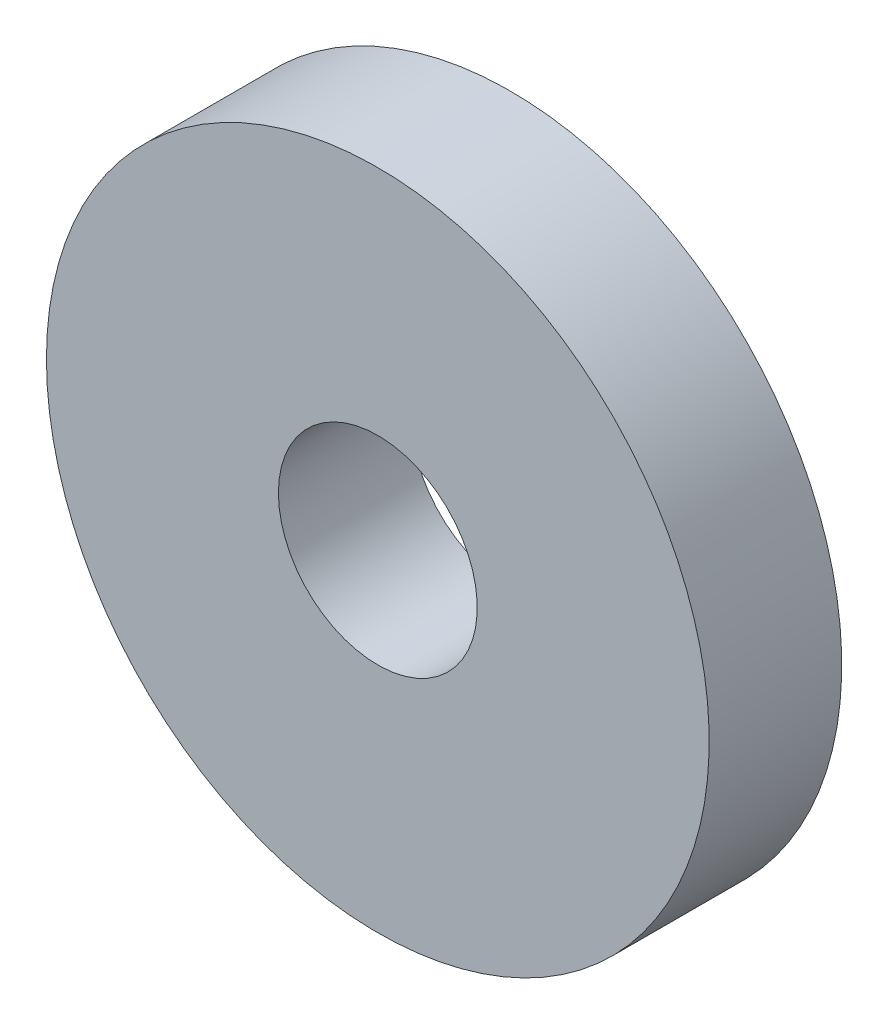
ISO-10303-21;
HEADER;
FILE_DESCRIPTION(('STEP AP214'),'2;1');
FILE_NAME('part.step','',(''),(''),'','','');
FILE_SCHEMA(('AUTOMOTIVE_DESIGN { 1 0 10303 214 1 1 1 1 }'));
ENDSEC;
DATA;
#1=APPLICATION_CONTEXT('core data for automotive mechanical design processes');
#2=APPLICATION_PROTOCOL_DEFINITION('international standard','automotive_design',2000,#1);
#3=PRODUCT_CONTEXT('',#1,'mechanical');
#4=PRODUCT('Part','Part','',(#3));
#5=PRODUCT_RELATED_PRODUCT_CATEGORY('part','',(#4));
#6=PRODUCT_DEFINITION_FORMATION('','',#4);
#7=PRODUCT_DEFINITION_CONTEXT('part definition',#1,'design');
#8=PRODUCT_DEFINITION('design','',#6,#7);
#9=PRODUCT_DEFINITION_SHAPE('','',#8);
#10=(LENGTH_UNIT() NAMED_UNIT(*) SI_UNIT(.MILLI.,.METRE.));
#11=(NAMED_UNIT(*) PLANE_ANGLE_UNIT() SI_UNIT($,.RADIAN.));
#12=(NAMED_UNIT(*) SI_UNIT($,.STERADIAN.) SOLID_ANGLE_UNIT());
#13=UNCERTAINTY_MEASURE_WITH_UNIT(LENGTH_MEASURE(1.E-05),#10,'distance_accuracy_value','');
#14=(GEOMETRIC_REPRESENTATION_CONTEXT(3) GLOBAL_UNCERTAINTY_ASSIGNED_CONTEXT((#13)) GLOBAL_UNIT_ASSIGNED_CONTEXT((#10,
#11,#12)) REPRESENTATION_CONTEXT('',''));
#15=CARTESIAN_POINT('',(0.,0.,0.));
#16=DIRECTION('',(0.,0.,1.));
#17=DIRECTION('',(1.,0.,0.));
#18=AXIS2_PLACEMENT_3D('',#15,#16,#17);
#19=CARTESIAN_POINT('',(0.,0.,9.9999999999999));
#20=DIRECTION('',(0.,0.,0.999999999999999));
#21=DIRECTION('',(1.,0.,0.));
#22=AXIS2_PLACEMENT_3D('',#19,#20,#21);
#23=PLANE('',#22);
#24=CARTESIAN_POINT('',(0.,0.,9.9999999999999));
#25=DIRECTION('',(0.,0.,0.999999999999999));
#26=DIRECTION('',(1.,0.,0.));
#27=AXIS2_PLACEMENT_3D('',#24,#25,#26);
#28=CIRCLE('',#27,25.);
#29=CARTESIAN_POINT('',(-25.,0.,9.9999999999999));
#30=VERTEX_POINT('',#29);
#31=EDGE_CURVE('E10',#30,#30,#28,.T.);
#32=ORIENTED_EDGE('',*,*,#31,.T.);
#33=EDGE_LOOP('',(#32));
#34=FACE_BOUND('',#33,.T.);
#35=CARTESIAN_POINT('',(0.,0.,9.9999999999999));
#36=DIRECTION('',(0.,0.,0.999999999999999));
#37=DIRECTION('',(1.,0.,0.));
#38=AXIS2_PLACEMENT_3D('',#35,#36,#37);
#39=CIRCLE('',#38,7.5);
#40=CARTESIAN_POINT('',(-7.50000000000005,0.,9.9999999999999));
#41=VERTEX_POINT('',#40);
#42=EDGE_CURVE('E46',#41,#41,#39,.T.);
#43=ORIENTED_EDGE('',*,*,#42,.F.);
#44=EDGE_LOOP('',(#43));
#45=FACE_BOUND('',#44,.T.);
#46=ADVANCED_FACE('F30',(#34,#45),#23,.T.);
#47=CARTESIAN_POINT('',(6.93889390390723E-13,0.,-1.11022302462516E-13));
#48=DIRECTION('',(0.,0.,0.999999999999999));
#49=DIRECTION('',(1.,0.,0.));
#50=AXIS2_PLACEMENT_3D('',#47,#48,#49);
#51=PLANE('',#50);
#52=CARTESIAN_POINT('',(6.93889390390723E-13,0.,-1.11022302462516E-13));
#53=DIRECTION('',(0.,0.,0.999999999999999));
#54=DIRECTION('',(1.,0.,0.));
#55=AXIS2_PLACEMENT_3D('',#52,#53,#54);
#56=CIRCLE('',#55,25.);
#57=CARTESIAN_POINT('',(-25.,0.,-1.09287578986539E-13));
#58=VERTEX_POINT('',#57);
#59=EDGE_CURVE('E38',#58,#58,#56,.T.);
#60=ORIENTED_EDGE('',*,*,#59,.F.);
#61=EDGE_LOOP('',(#60));
#62=FACE_BOUND('',#61,.T.);
#63=CARTESIAN_POINT('',(6.93889390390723E-13,0.,-1.11022302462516E-13));
#64=DIRECTION('',(0.,0.,0.999999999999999));
#65=DIRECTION('',(1.,0.,0.));
#66=AXIS2_PLACEMENT_3D('',#63,#64,#65);
#67=CIRCLE('',#66,7.5);
#68=CARTESIAN_POINT('',(-7.50000000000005,0.,-1.09287578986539E-13));
#69=VERTEX_POINT('',#68);
#70=EDGE_CURVE('E53',#69,#69,#67,.T.);
#71=ORIENTED_EDGE('',*,*,#70,.T.);
#72=EDGE_LOOP('',(#71));
#73=FACE_BOUND('',#72,.T.);
#74=ADVANCED_FACE('F59',(#62,#73),#51,.F.);
#75=CARTESIAN_POINT('',(0.,0.,9.9999999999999));
#76=DIRECTION('',(0.,0.,-0.999999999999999));
#77=DIRECTION('',(-1.,0.,0.));
#78=AXIS2_PLACEMENT_3D('',#75,#76,#77);
#79=CYLINDRICAL_SURFACE('',#78,25.);
#80=CARTESIAN_POINT('',(-25.,0.,9.9999999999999));
#81=CARTESIAN_POINT('',(-25.,0.,9.89583333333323));
#82=CARTESIAN_POINT('',(-25.,0.,9.79166666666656));
#83=CARTESIAN_POINT('',(-25.,0.,9.58333333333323));
#84=CARTESIAN_POINT('',(-25.,0.,9.47916666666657));
#85=CARTESIAN_POINT('',(-25.,0.,9.27083333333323));
#86=CARTESIAN_POINT('',(-25.,0.,9.16666666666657));
#87=CARTESIAN_POINT('',(-25.,0.,8.95833333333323));
#88=CARTESIAN_POINT('',(-25.,0.,8.85416666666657));
#89=CARTESIAN_POINT('',(-25.,0.,8.64583333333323));
#90=CARTESIAN_POINT('',(-25.,0.,8.54166666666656));
#91=CARTESIAN_POINT('',(-25.,0.,8.33333333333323));
#92=CARTESIAN_POINT('',(-25.,0.,8.22916666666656));
#93=CARTESIAN_POINT('',(-25.,0.,8.02083333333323));
#94=CARTESIAN_POINT('',(-25.,0.,7.91666666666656));
#95=CARTESIAN_POINT('',(-25.,0.,7.70833333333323));
#96=CARTESIAN_POINT('',(-25.,0.,7.60416666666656));
#97=CARTESIAN_POINT('',(-25.,0.,7.39583333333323));
#98=CARTESIAN_POINT('',(-25.,0.,7.29166666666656));
#99=CARTESIAN_POINT('',(-25.,0.,7.08333333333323));
#100=CARTESIAN_POINT('',(-25.,0.,6.97916666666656));
#101=CARTESIAN_POINT('',(-25.,0.,6.77083333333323));
#102=CARTESIAN_POINT('',(-25.,0.,6.66666666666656));
#103=CARTESIAN_POINT('',(-25.,0.,6.45833333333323));
#104=CARTESIAN_POINT('',(-25.,0.,6.35416666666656));
#105=CARTESIAN_POINT('',(-25.,0.,6.14583333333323));
#106=CARTESIAN_POINT('',(-25.,0.,6.04166666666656));
#107=CARTESIAN_POINT('',(-25.,0.,5.83333333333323));
#108=CARTESIAN_POINT('',(-25.,0.,5.72916666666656));
#109=CARTESIAN_POINT('',(-25.,0.,5.52083333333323));
#110=CARTESIAN_POINT('',(-25.,0.,5.41666666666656));
#111=CARTESIAN_POINT('',(-25.,0.,5.20833333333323));
#112=CARTESIAN_POINT('',(-25.,0.,5.10416666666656));
#113=CARTESIAN_POINT('',(-25.,0.,4.89583333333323));
#114=CARTESIAN_POINT('',(-25.,0.,4.79166666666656));
#115=CARTESIAN_POINT('',(-25.,0.,4.58333333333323));
#116=CARTESIAN_POINT('',(-25.,0.,4.47916666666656));
#117=CARTESIAN_POINT('',(-25.,0.,4.27083333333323));
#118=CARTESIAN_POINT('',(-25.,0.,4.16666666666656));
#119=CARTESIAN_POINT('',(-25.,0.,3.95833333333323));
#120=CARTESIAN_POINT('',(-25.,0.,3.85416666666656));
#121=CARTESIAN_POINT('',(-25.,0.,3.64583333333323));
#122=CARTESIAN_POINT('',(-25.,0.,3.54166666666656));
#123=CARTESIAN_POINT('',(-25.,0.,3.33333333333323));
#124=CARTESIAN_POINT('',(-25.,0.,3.22916666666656));
#125=CARTESIAN_POINT('',(-25.,0.,3.02083333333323));
#126=CARTESIAN_POINT('',(-25.,0.,2.91666666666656));
#127=CARTESIAN_POINT('',(-25.,0.,2.70833333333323));
#128=CARTESIAN_POINT('',(-25.,0.,2.60416666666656));
#129=CARTESIAN_POINT('',(-25.,0.,2.39583333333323));
#130=CARTESIAN_POINT('',(-25.,0.,2.29166666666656));
#131=CARTESIAN_POINT('',(-25.,0.,2.08333333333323));
#132=CARTESIAN_POINT('',(-25.,0.,1.97916666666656));
#133=CARTESIAN_POINT('',(-25.,0.,1.77083333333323));
#134=CARTESIAN_POINT('',(-25.,0.,1.66666666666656));
#135=CARTESIAN_POINT('',(-25.,0.,1.45833333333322));
#136=CARTESIAN_POINT('',(-25.,0.,1.35416666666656));
#137=CARTESIAN_POINT('',(-25.,0.,1.14583333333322));
#138=CARTESIAN_POINT('',(-25.,0.,1.04166666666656));
#139=CARTESIAN_POINT('',(-25.,0.,0.833333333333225));
#140=CARTESIAN_POINT('',(-25.,0.,0.729166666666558));
#141=CARTESIAN_POINT('',(-25.,0.,0.520833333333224));
#142=CARTESIAN_POINT('',(-25.,0.,0.416666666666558));
#143=CARTESIAN_POINT('',(-25.,0.,0.208333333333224));
#144=CARTESIAN_POINT('',(-25.,0.,0.104166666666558));
#145=CARTESIAN_POINT('',(-25.,0.,-1.09287578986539E-13));
#146=B_SPLINE_CURVE_WITH_KNOTS('',3,(#80,#81,#82,#83,#84,#85,#86,#87,#88,#89,#90,#91,#92,#93,
#94,#95,#96,#97,#98,#99,#100,#101,#102,#103,#104,#105,#106,#107,#108,#109,#110,#111,#112,#113,
#114,#115,#116,#117,#118,#119,#120,#121,#122,#123,#124,#125,#126,#127,#128,#129,#130,#131,#132,
#133,#134,#135,#136,#137,#138,#139,#140,#141,#142,#143,#144,#145),.UNSPECIFIED.,.F.,.F.,(4,2,2,
2,2,2,2,2,2,2,2,2,2,2,2,2,2,2,2,2,2,2,2,2,2,2,2,2,2,2,2,2,4),(0.,0.312499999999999,
0.624999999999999,0.937499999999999,1.25,1.5625,1.875,2.1875,2.5,2.8125,3.125,3.4375,3.75,
4.0625,4.375,4.6875,5.,5.3125,5.625,5.9375,6.25,6.5625,6.875,7.1875,7.5,7.81250000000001,
8.12500000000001,8.43750000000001,8.75000000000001,9.06250000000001,9.37500000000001,
9.68750000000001,10.),.UNSPECIFIED.);
#147=EDGE_CURVE('BSEAM32',#30,#58,#146,.T.);
#148=ORIENTED_EDGE('',*,*,#31,.F.);
#149=ORIENTED_EDGE('',*,*,#59,.T.);
#150=ORIENTED_EDGE('',*,*,#147,.T.);
#151=ORIENTED_EDGE('',*,*,#147,.F.);
#152=EDGE_LOOP('',(#148,#150,#149,#151));
#153=FACE_BOUND('',#152,.T.);
#154=ADVANCED_FACE('F32',(#153),#79,.T.);
#155=CARTESIAN_POINT('',(0.,0.,9.9999999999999));
#156=DIRECTION('',(0.,0.,-0.999999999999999));
#157=DIRECTION('',(-1.,0.,0.));
#158=AXIS2_PLACEMENT_3D('',#155,#156,#157);
#159=CYLINDRICAL_SURFACE('',#158,7.5);
#160=CARTESIAN_POINT('',(-7.50000000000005,0.,9.9999999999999));
#161=CARTESIAN_POINT('',(-7.50000000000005,0.,9.89583333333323));
#162=CARTESIAN_POINT('',(-7.50000000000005,0.,9.79166666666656));
#163=CARTESIAN_POINT('',(-7.50000000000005,0.,9.58333333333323));
#164=CARTESIAN_POINT('',(-7.50000000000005,0.,9.47916666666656));
#165=CARTESIAN_POINT('',(-7.50000000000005,0.,9.27083333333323));
#166=CARTESIAN_POINT('',(-7.50000000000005,0.,9.16666666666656));
#167=CARTESIAN_POINT('',(-7.50000000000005,0.,8.95833333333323));
#168=CARTESIAN_POINT('',(-7.50000000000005,0.,8.85416666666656));
#169=CARTESIAN_POINT('',(-7.50000000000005,0.,8.64583333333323));
#170=CARTESIAN_POINT('',(-7.50000000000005,0.,8.54166666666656));
#171=CARTESIAN_POINT('',(-7.50000000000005,0.,8.33333333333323));
#172=CARTESIAN_POINT('',(-7.50000000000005,0.,8.22916666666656));
#173=CARTESIAN_POINT('',(-7.50000000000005,0.,8.02083333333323));
#174=CARTESIAN_POINT('',(-7.50000000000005,0.,7.91666666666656));
#175=CARTESIAN_POINT('',(-7.50000000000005,0.,7.70833333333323));
#176=CARTESIAN_POINT('',(-7.50000000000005,0.,7.60416666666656));
#177=CARTESIAN_POINT('',(-7.50000000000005,0.,7.39583333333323));
#178=CARTESIAN_POINT('',(-7.50000000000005,0.,7.29166666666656));
#179=CARTESIAN_POINT('',(-7.50000000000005,0.,7.08333333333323));
#180=CARTESIAN_POINT('',(-7.50000000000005,0.,6.97916666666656));
#181=CARTESIAN_POINT('',(-7.50000000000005,0.,6.77083333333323));
#182=CARTESIAN_POINT('',(-7.50000000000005,0.,6.66666666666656));
#183=CARTESIAN_POINT('',(-7.50000000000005,0.,6.45833333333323));
#184=CARTESIAN_POINT('',(-7.50000000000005,0.,6.35416666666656));
#185=CARTESIAN_POINT('',(-7.50000000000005,0.,6.14583333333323));
#186=CARTESIAN_POINT('',(-7.50000000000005,0.,6.04166666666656));
#187=CARTESIAN_POINT('',(-7.50000000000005,0.,5.83333333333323));
#188=CARTESIAN_POINT('',(-7.50000000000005,0.,5.72916666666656));
#189=CARTESIAN_POINT('',(-7.50000000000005,0.,5.52083333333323));
#190=CARTESIAN_POINT('',(-7.50000000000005,0.,5.41666666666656));
#191=CARTESIAN_POINT('',(-7.50000000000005,0.,5.20833333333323));
#192=CARTESIAN_POINT('',(-7.50000000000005,0.,5.10416666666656));
#193=CARTESIAN_POINT('',(-7.50000000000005,0.,4.89583333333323));
#194=CARTESIAN_POINT('',(-7.50000000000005,0.,4.79166666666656));
#195=CARTESIAN_POINT('',(-7.50000000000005,0.,4.58333333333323));
#196=CARTESIAN_POINT('',(-7.50000000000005,0.,4.47916666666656));
#197=CARTESIAN_POINT('',(-7.50000000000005,0.,4.27083333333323));
#198=CARTESIAN_POINT('',(-7.50000000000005,0.,4.16666666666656));
#199=CARTESIAN_POINT('',(-7.50000000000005,0.,3.95833333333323));
#200=CARTESIAN_POINT('',(-7.50000000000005,0.,3.85416666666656));
#201=CARTESIAN_POINT('',(-7.50000000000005,0.,3.64583333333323));
#202=CARTESIAN_POINT('',(-7.50000000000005,0.,3.54166666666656));
#203=CARTESIAN_POINT('',(-7.50000000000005,0.,3.33333333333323));
#204=CARTESIAN_POINT('',(-7.50000000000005,0.,3.22916666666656));
#205=CARTESIAN_POINT('',(-7.50000000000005,0.,3.02083333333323));
#206=CARTESIAN_POINT('',(-7.50000000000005,0.,2.91666666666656));
#207=CARTESIAN_POINT('',(-7.50000000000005,0.,2.70833333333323));
#208=CARTESIAN_POINT('',(-7.50000000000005,0.,2.60416666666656));
#209=CARTESIAN_POINT('',(-7.50000000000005,0.,2.39583333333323));
#210=CARTESIAN_POINT('',(-7.50000000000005,0.,2.29166666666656));
#211=CARTESIAN_POINT('',(-7.50000000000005,0.,2.08333333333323));
#212=CARTESIAN_POINT('',(-7.50000000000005,0.,1.97916666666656));
#213=CARTESIAN_POINT('',(-7.50000000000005,0.,1.77083333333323));
#214=CARTESIAN_POINT('',(-7.50000000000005,0.,1.66666666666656));
#215=CARTESIAN_POINT('',(-7.50000000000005,0.,1.45833333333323));
#216=CARTESIAN_POINT('',(-7.50000000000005,0.,1.35416666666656));
#217=CARTESIAN_POINT('',(-7.50000000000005,0.,1.14583333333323));
#218=CARTESIAN_POINT('',(-7.50000000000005,0.,1.04166666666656));
#219=CARTESIAN_POINT('',(-7.50000000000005,0.,0.833333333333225));
#220=CARTESIAN_POINT('',(-7.50000000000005,0.,0.729166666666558));
#221=CARTESIAN_POINT('',(-7.50000000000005,0.,0.520833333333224));
#222=CARTESIAN_POINT('',(-7.50000000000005,0.,0.416666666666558));
#223=CARTESIAN_POINT('',(-7.50000000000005,0.,0.208333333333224));
#224=CARTESIAN_POINT('',(-7.50000000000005,0.,0.104166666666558));
#225=CARTESIAN_POINT('',(-7.50000000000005,0.,-1.09287578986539E-13));
#226=B_SPLINE_CURVE_WITH_KNOTS('',3,(#160,#161,#162,#163,#164,#165,#166,#167,#168,#169,#170,
#171,#172,#173,#174,#175,#176,#177,#178,#179,#180,#181,#182,#183,#184,#185,#186,#187,#188,#189,
#190,#191,#192,#193,#194,#195,#196,#197,#198,#199,#200,#201,#202,#203,#204,#205,#206,#207,#208,
#209,#210,#211,#212,#213,#214,#215,#216,#217,#218,#219,#220,#221,#222,#223,#224,#225),
.UNSPECIFIED.,.F.,.F.,(4,2,2,2,2,2,2,2,2,2,2,2,2,2,2,2,2,2,2,2,2,2,2,2,2,2,2,2,2,2,2,2,4),(0.,
0.312500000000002,0.625000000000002,0.937500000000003,1.25,1.5625,1.875,2.1875,2.5,2.8125,3.125,
3.4375,3.75,4.0625,4.375,4.68750000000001,5.00000000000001,5.31250000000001,5.62500000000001,
5.93750000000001,6.25000000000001,6.56250000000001,6.87500000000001,7.18750000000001,
7.50000000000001,7.81250000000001,8.12500000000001,8.43750000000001,8.75000000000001,
9.06250000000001,9.37500000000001,9.68750000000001,10.),.UNSPECIFIED.);
#227=EDGE_CURVE('BSEAM61',#41,#69,#226,.T.);
#228=ORIENTED_EDGE('',*,*,#42,.T.);
#229=ORIENTED_EDGE('',*,*,#70,.F.);
#230=ORIENTED_EDGE('',*,*,#227,.T.);
#231=ORIENTED_EDGE('',*,*,#227,.F.);
#232=EDGE_LOOP('',(#228,#230,#229,#231));
#233=FACE_BOUND('',#232,.T.);
#234=ADVANCED_FACE('F61',(#233),#159,.F.);
#235=CLOSED_SHELL('',(#46,#74,#154,#234));
#236=MANIFOLD_SOLID_BREP('B2',#235);
#237=ADVANCED_BREP_SHAPE_REPRESENTATION('',(#18,#236),#14);
#238=SHAPE_DEFINITION_REPRESENTATION(#9,#237);
ENDSEC;
END-ISO-10303-21;
